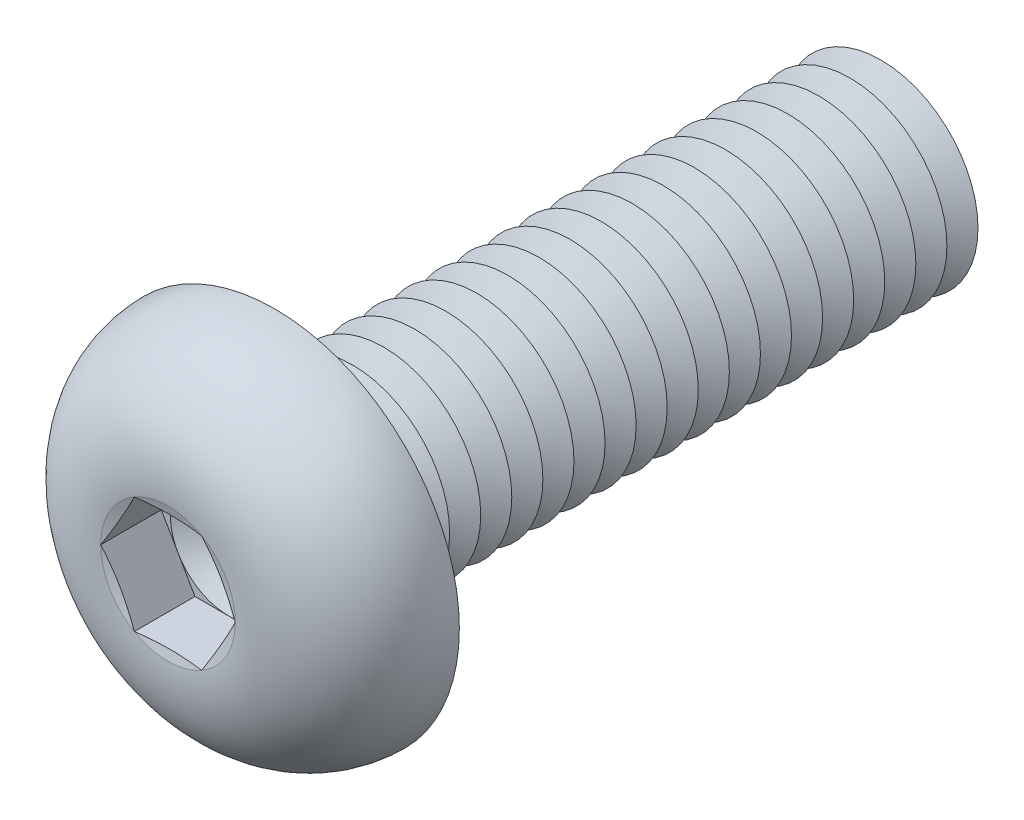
ISO-10303-21;
HEADER;
FILE_DESCRIPTION(('STEP AP214'),'2;1');
FILE_NAME('part.step','',(''),(''),'','','');
FILE_SCHEMA(('AUTOMOTIVE_DESIGN { 1 0 10303 214 1 1 1 1 }'));
ENDSEC;
DATA;
#1=APPLICATION_CONTEXT('core data for automotive mechanical design processes');
#2=APPLICATION_PROTOCOL_DEFINITION('international standard','automotive_design',2000,#1);
#3=PRODUCT_CONTEXT('',#1,'mechanical');
#4=PRODUCT('Part','Part','',(#3));
#5=PRODUCT_RELATED_PRODUCT_CATEGORY('part','',(#4));
#6=PRODUCT_DEFINITION_FORMATION('','',#4);
#7=PRODUCT_DEFINITION_CONTEXT('part definition',#1,'design');
#8=PRODUCT_DEFINITION('design','',#6,#7);
#9=PRODUCT_DEFINITION_SHAPE('','',#8);
#10=(LENGTH_UNIT() NAMED_UNIT(*) SI_UNIT(.MILLI.,.METRE.));
#11=(NAMED_UNIT(*) PLANE_ANGLE_UNIT() SI_UNIT($,.RADIAN.));
#12=(NAMED_UNIT(*) SI_UNIT($,.STERADIAN.) SOLID_ANGLE_UNIT());
#13=UNCERTAINTY_MEASURE_WITH_UNIT(LENGTH_MEASURE(1.E-05),#10,'distance_accuracy_value','');
#14=(GEOMETRIC_REPRESENTATION_CONTEXT(3) GLOBAL_UNCERTAINTY_ASSIGNED_CONTEXT((#13)) GLOBAL_UNIT_ASSIGNED_CONTEXT((#10,
#11,#12)) REPRESENTATION_CONTEXT('',''));
#15=CARTESIAN_POINT('',(0.,0.,0.));
#16=DIRECTION('',(0.,0.,1.));
#17=DIRECTION('',(1.,0.,0.));
#18=AXIS2_PLACEMENT_3D('',#15,#16,#17);
#19=CARTESIAN_POINT('',(0.,0.,1.19));
#20=DIRECTION('',(0.,0.,1.));
#21=DIRECTION('',(1.,0.,0.));
#22=AXIS2_PLACEMENT_3D('',#19,#20,#21);
#23=PLANE('',#22);
#24=CARTESIAN_POINT('',(0.,0.,1.19));
#25=DIRECTION('',(0.,0.,1.));
#26=DIRECTION('',(1.,0.,0.));
#27=AXIS2_PLACEMENT_3D('',#24,#25,#26);
#28=CIRCLE('',#27,1.49999930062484);
#29=CARTESIAN_POINT('',(1.2990375,0.749999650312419,1.19));
#30=VERTEX_POINT('',#29);
#31=CARTESIAN_POINT('',(0.,1.49999930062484,1.19));
#32=VERTEX_POINT('',#31);
#33=EDGE_CURVE('E118',#30,#32,#28,.T.);
#34=ORIENTED_EDGE('',*,*,#33,.F.);
#35=DIRECTION('',(-0.5,0.866025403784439,0.));
#36=VECTOR('',#35,1.);
#37=CARTESIAN_POINT('',(1.73205,0.,1.19));
#38=LINE('',#37,#36);
#39=CARTESIAN_POINT('',(0.866025,1.49999930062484,1.19));
#40=VERTEX_POINT('',#39);
#41=EDGE_CURVE('E125',#30,#40,#38,.T.);
#42=ORIENTED_EDGE('',*,*,#41,.T.);
#43=DIRECTION('',(-1.,0.,0.));
#44=VECTOR('',#43,1.);
#45=CARTESIAN_POINT('',(0.866025,1.49999930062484,1.19));
#46=LINE('',#45,#44);
#47=EDGE_CURVE('E136',#40,#32,#46,.T.);
#48=ORIENTED_EDGE('',*,*,#47,.T.);
#49=EDGE_LOOP('',(#34,#42,#48));
#50=FACE_BOUND('',#49,.T.);
#51=ADVANCED_FACE('F39',(#50),#23,.T.);
#52=CARTESIAN_POINT('',(0.,0.,1.19));
#53=DIRECTION('',(0.,0.,1.));
#54=DIRECTION('',(1.,0.,0.));
#55=AXIS2_PLACEMENT_3D('',#52,#53,#54);
#56=CIRCLE('',#55,1.49999930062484);
#57=CARTESIAN_POINT('',(-1.2990375,0.749999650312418,1.19));
#58=VERTEX_POINT('',#57);
#59=EDGE_CURVE('E11',#32,#58,#56,.T.);
#60=ORIENTED_EDGE('',*,*,#59,.F.);
#61=CARTESIAN_POINT('',(-0.866025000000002,1.49999930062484,1.19));
#62=VERTEX_POINT('',#61);
#63=EDGE_CURVE('E131',#32,#62,#46,.T.);
#64=ORIENTED_EDGE('',*,*,#63,.T.);
#65=DIRECTION('',(-0.5,-0.866025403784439,0.));
#66=VECTOR('',#65,1.);
#67=CARTESIAN_POINT('',(-0.866025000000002,1.49999930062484,1.19));
#68=LINE('',#67,#66);
#69=EDGE_CURVE('E134',#62,#58,#68,.T.);
#70=ORIENTED_EDGE('',*,*,#69,.T.);
#71=EDGE_LOOP('',(#60,#64,#70));
#72=FACE_BOUND('',#71,.T.);
#73=ADVANCED_FACE('F130',(#72),#23,.T.);
#74=CARTESIAN_POINT('',(-1.2990375,-0.749999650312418,1.19));
#75=VERTEX_POINT('',#74);
#76=EDGE_CURVE('E49',#58,#75,#56,.T.);
#77=ORIENTED_EDGE('',*,*,#76,.F.);
#78=CARTESIAN_POINT('',(-1.73205,0.,1.19));
#79=VERTEX_POINT('',#78);
#80=EDGE_CURVE('E143',#58,#79,#68,.T.);
#81=ORIENTED_EDGE('',*,*,#80,.T.);
#82=DIRECTION('',(0.5,-0.866025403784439,0.));
#83=VECTOR('',#82,1.);
#84=CARTESIAN_POINT('',(-1.73205,0.,1.19));
#85=LINE('',#84,#83);
#86=EDGE_CURVE('E151',#79,#75,#85,.T.);
#87=ORIENTED_EDGE('',*,*,#86,.T.);
#88=EDGE_LOOP('',(#77,#81,#87));
#89=FACE_BOUND('',#88,.T.);
#90=ADVANCED_FACE('F427',(#89),#23,.T.);
#91=CARTESIAN_POINT('',(0.,-1.49999930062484,1.19));
#92=VERTEX_POINT('',#91);
#93=EDGE_CURVE('E410',#75,#92,#56,.T.);
#94=ORIENTED_EDGE('',*,*,#93,.F.);
#95=CARTESIAN_POINT('',(-0.866025,-1.49999930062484,1.19));
#96=VERTEX_POINT('',#95);
#97=EDGE_CURVE('E150',#75,#96,#85,.T.);
#98=ORIENTED_EDGE('',*,*,#97,.T.);
#99=DIRECTION('',(1.,0.,0.));
#100=VECTOR('',#99,1.);
#101=CARTESIAN_POINT('',(-0.866025,-1.49999930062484,1.19));
#102=LINE('',#101,#100);
#103=EDGE_CURVE('E156',#96,#92,#102,.T.);
#104=ORIENTED_EDGE('',*,*,#103,.T.);
#105=EDGE_LOOP('',(#94,#98,#104));
#106=FACE_BOUND('',#105,.T.);
#107=ADVANCED_FACE('F420',(#106),#23,.T.);
#108=CARTESIAN_POINT('',(1.2990375,-0.749999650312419,1.19));
#109=VERTEX_POINT('',#108);
#110=EDGE_CURVE('E56',#92,#109,#56,.T.);
#111=ORIENTED_EDGE('',*,*,#110,.F.);
#112=CARTESIAN_POINT('',(0.866025,-1.49999930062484,1.19));
#113=VERTEX_POINT('',#112);
#114=EDGE_CURVE('E155',#92,#113,#102,.T.);
#115=ORIENTED_EDGE('',*,*,#114,.T.);
#116=DIRECTION('',(0.5,0.866025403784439,0.));
#117=VECTOR('',#116,1.);
#118=CARTESIAN_POINT('',(0.866025,-1.49999930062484,1.19));
#119=LINE('',#118,#117);
#120=EDGE_CURVE('E161',#113,#109,#119,.T.);
#121=ORIENTED_EDGE('',*,*,#120,.T.);
#122=EDGE_LOOP('',(#111,#115,#121));
#123=FACE_BOUND('',#122,.T.);
#124=ADVANCED_FACE('F499',(#123),#23,.T.);
#125=CARTESIAN_POINT('',(0.,0.,2.75));
#126=DIRECTION('',(0.,0.,1.));
#127=DIRECTION('',(1.,0.,0.));
#128=AXIS2_PLACEMENT_3D('',#125,#126,#127);
#129=CONICAL_SURFACE('',#128,1.73205,1.30899693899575);
#130=CARTESIAN_POINT('',(1.73216547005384,-0.000200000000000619,2.75003094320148));
#131=CARTESIAN_POINT('',(1.69619207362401,0.0621077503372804,2.74038633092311));
#132=CARTESIAN_POINT('',(1.66015343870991,0.124528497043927,2.73163050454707));
#133=CARTESIAN_POINT('',(1.58794885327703,0.249590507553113,2.71624720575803));
#134=CARTESIAN_POINT('',(1.5517828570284,0.312231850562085,2.70962059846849));
#135=CARTESIAN_POINT('',(1.47954289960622,0.437355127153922,2.69888271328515));
#136=CARTESIAN_POINT('',(1.4434694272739,0.499836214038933,2.69475862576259));
#137=CARTESIAN_POINT('',(1.37127646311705,0.624878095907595,2.68922863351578));
#138=CARTESIAN_POINT('',(1.33515698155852,0.687438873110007,2.68782220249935));
#139=CARTESIAN_POINT('',(1.26291801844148,0.812560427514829,2.68782220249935));
#140=CARTESIAN_POINT('',(1.22679853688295,0.87512120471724,2.68922863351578));
#141=CARTESIAN_POINT('',(1.1546055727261,1.0001630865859,2.69475862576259));
#142=CARTESIAN_POINT('',(1.11853210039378,1.06264417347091,2.69888271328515));
#143=CARTESIAN_POINT('',(1.0462921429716,1.18776745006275,2.70962059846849));
#144=CARTESIAN_POINT('',(1.01012614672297,1.25040879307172,2.71624720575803));
#145=CARTESIAN_POINT('',(0.937921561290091,1.37547080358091,2.73163050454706));
#146=CARTESIAN_POINT('',(0.901882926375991,1.43789155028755,2.74038633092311));
#147=CARTESIAN_POINT('',(0.865909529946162,1.50019930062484,2.75003094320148));
#148=B_SPLINE_CURVE_WITH_KNOTS('',3,(#130,#131,#132,#133,#134,#135,#136,#137,#138,#139,#140,
#141,#142,#143,#144,#145,#146,#147),.UNSPECIFIED.,.F.,.F.,(4,2,2,2,2,2,2,2,4),(0.,
0.217782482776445,0.435653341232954,0.652399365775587,0.869103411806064,1.08580745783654,
1.30255348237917,1.52042434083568,1.73820682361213),.UNSPECIFIED.);
#149=CARTESIAN_POINT('',(1.73205,0.,2.75));
#150=VERTEX_POINT('',#149);
#151=CARTESIAN_POINT('',(0.866025,1.49999930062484,2.75));
#152=VERTEX_POINT('',#151);
#153=EDGE_CURVE('E220',#150,#152,#148,.T.);
#154=ORIENTED_EDGE('',*,*,#153,.F.);
#155=CARTESIAN_POINT('',(0.,0.,2.75));
#156=DIRECTION('',(0.,0.,-1.));
#157=DIRECTION('',(-1.,0.,0.));
#158=AXIS2_PLACEMENT_3D('',#155,#156,#157);
#159=CIRCLE('',#158,1.73205);
#160=EDGE_CURVE('E458',#152,#150,#159,.T.);
#161=ORIENTED_EDGE('',*,*,#160,.F.);
#162=EDGE_LOOP('',(#154,#161));
#163=FACE_BOUND('',#162,.T.);
#164=ADVANCED_FACE('F503',(#163),#129,.F.);
#165=CARTESIAN_POINT('',(0.865909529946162,-1.50019930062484,2.75003094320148));
#166=CARTESIAN_POINT('',(0.901882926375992,-1.43789155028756,2.74038633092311));
#167=CARTESIAN_POINT('',(0.937921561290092,-1.37547080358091,2.73163050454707));
#168=CARTESIAN_POINT('',(1.01012614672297,-1.25040879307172,2.71624720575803));
#169=CARTESIAN_POINT('',(1.0462921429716,-1.18776745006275,2.70962059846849));
#170=CARTESIAN_POINT('',(1.11853210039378,-1.06264417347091,2.69888271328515));
#171=CARTESIAN_POINT('',(1.1546055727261,-1.0001630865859,2.69475862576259));
#172=CARTESIAN_POINT('',(1.22679853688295,-0.875121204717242,2.68922863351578));
#173=CARTESIAN_POINT('',(1.26291801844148,-0.81256042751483,2.68782220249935));
#174=CARTESIAN_POINT('',(1.33515698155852,-0.687438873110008,2.68782220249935));
#175=CARTESIAN_POINT('',(1.37127646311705,-0.624878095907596,2.68922863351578));
#176=CARTESIAN_POINT('',(1.4434694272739,-0.499836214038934,2.69475862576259));
#177=CARTESIAN_POINT('',(1.47954289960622,-0.437355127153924,2.69888271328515));
#178=CARTESIAN_POINT('',(1.5517828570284,-0.312231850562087,2.70962059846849));
#179=CARTESIAN_POINT('',(1.58794885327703,-0.249590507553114,2.71624720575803));
#180=CARTESIAN_POINT('',(1.66015343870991,-0.124528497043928,2.73163050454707));
#181=CARTESIAN_POINT('',(1.69619207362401,-0.0621077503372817,2.74038633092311));
#182=CARTESIAN_POINT('',(1.73216547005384,0.000199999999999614,2.75003094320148));
#183=B_SPLINE_CURVE_WITH_KNOTS('',3,(#165,#166,#167,#168,#169,#170,#171,#172,#173,#174,#175,
#176,#177,#178,#179,#180,#181,#182),.UNSPECIFIED.,.F.,.F.,(4,2,2,2,2,2,2,2,4),(0.,
0.217782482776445,0.435653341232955,0.652399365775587,0.869103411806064,1.08580745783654,
1.30255348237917,1.52042434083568,1.73820682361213),.UNSPECIFIED.);
#184=CARTESIAN_POINT('',(0.866025,-1.49999930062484,2.75));
#185=VERTEX_POINT('',#184);
#186=EDGE_CURVE('E229',#185,#150,#183,.T.);
#187=ORIENTED_EDGE('',*,*,#186,.F.);
#188=EDGE_CURVE('E460',#150,#185,#159,.T.);
#189=ORIENTED_EDGE('',*,*,#188,.F.);
#190=EDGE_LOOP('',(#187,#189));
#191=FACE_BOUND('',#190,.T.);
#192=ADVANCED_FACE('F465',(#191),#129,.F.);
#193=CARTESIAN_POINT('',(-2.61375031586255,-1.49999930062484,3.09338600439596));
#194=CARTESIAN_POINT('',(-2.48719895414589,-1.49999930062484,3.06401688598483));
#195=CARTESIAN_POINT('',(-2.36054180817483,-1.49999930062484,3.03507426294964));
#196=CARTESIAN_POINT('',(-2.10688190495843,-1.49999930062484,2.97862489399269));
#197=CARTESIAN_POINT('',(-1.97987908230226,-1.49999930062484,2.95111844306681));
#198=CARTESIAN_POINT('',(-1.72425281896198,-1.49999930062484,2.89788845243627));
#199=CARTESIAN_POINT('',(-1.59562534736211,-1.49999930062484,2.87218404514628));
#200=CARTESIAN_POINT('',(-1.33776732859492,-1.49999930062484,2.82387586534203));
#201=CARTESIAN_POINT('',(-1.20853672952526,-1.49999930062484,2.80127236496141));
#202=CARTESIAN_POINT('',(-0.952831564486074,-1.49999930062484,2.76126658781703));
#203=CARTESIAN_POINT('',(-0.826376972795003,-1.49999930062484,2.74374018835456));
#204=CARTESIAN_POINT('',(-0.572755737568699,-1.49999930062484,2.71502809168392));
#205=CARTESIAN_POINT('',(-0.445589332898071,-1.49999930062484,2.70384038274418));
#206=CARTESIAN_POINT('',(-0.191333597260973,-1.49999930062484,2.68972083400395));
#207=CARTESIAN_POINT('',(-0.0642464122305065,-1.49999930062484,2.68675270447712));
#208=CARTESIAN_POINT('',(0.189835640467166,-1.49999930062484,2.68959577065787));
#209=CARTESIAN_POINT('',(0.31683049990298,-1.49999930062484,2.69540767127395));
#210=CARTESIAN_POINT('',(0.53418249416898,-1.49999930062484,2.71190493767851));
#211=CARTESIAN_POINT('',(0.624691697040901,-1.49999930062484,2.72073513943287));
#212=CARTESIAN_POINT('',(0.805336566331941,-1.49999930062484,2.74156379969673));
#213=CARTESIAN_POINT('',(0.895472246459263,-1.49999930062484,2.75356214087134));
#214=CARTESIAN_POINT('',(1.0756572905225,-1.49999930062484,2.78006977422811));
#215=CARTESIAN_POINT('',(1.16570548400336,-1.49999930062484,2.7945868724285));
#216=CARTESIAN_POINT('',(1.3454787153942,-1.49999930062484,2.82550612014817));
#217=CARTESIAN_POINT('',(1.43520373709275,-1.49999930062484,2.8419083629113));
#218=CARTESIAN_POINT('',(1.61622412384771,-1.49999930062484,2.87648604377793));
#219=CARTESIAN_POINT('',(1.70751379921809,-1.49999930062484,2.89469103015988));
#220=CARTESIAN_POINT('',(1.88986344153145,-1.49999930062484,2.93221618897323));
#221=CARTESIAN_POINT('',(1.98092340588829,-1.49999930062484,2.95153637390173));
#222=CARTESIAN_POINT('',(2.16236354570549,-1.49999930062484,2.99091506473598));
#223=CARTESIAN_POINT('',(2.25274472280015,-1.49999930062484,3.01096897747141));
#224=CARTESIAN_POINT('',(2.43335289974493,-1.49999930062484,3.05173139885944));
#225=CARTESIAN_POINT('',(2.52357990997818,-1.49999930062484,3.07243986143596));
#226=CARTESIAN_POINT('',(2.61375031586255,-1.49999930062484,3.09338600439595));
#227=B_SPLINE_CURVE_WITH_KNOTS('',3,(#193,#194,#195,#196,#197,#198,#199,#200,#201,#202,#203,
#204,#205,#206,#207,#208,#209,#210,#211,#212,#213,#214,#215,#216,#217,#218,#219,#220,#221,#222,
#223,#224,#225,#226),.UNSPECIFIED.,.F.,.F.,(4,2,2,2,2,2,2,2,2,2,2,2,2,2,2,2,4),(0.,
0.389753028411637,0.779585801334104,1.17307326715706,1.5665952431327,1.94947555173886,
2.33223427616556,2.71330039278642,3.09439710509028,3.36715350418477,3.63989980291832,
3.91350699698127,4.18712773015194,4.4663802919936,4.74563598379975,5.02337106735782,
5.3010866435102),.UNSPECIFIED.);
#228=CARTESIAN_POINT('',(-0.866025,-1.49999930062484,2.75));
#229=VERTEX_POINT('',#228);
#230=EDGE_CURVE('E439',#229,#185,#227,.T.);
#231=ORIENTED_EDGE('',*,*,#230,.F.);
#232=EDGE_CURVE('E447',#185,#229,#159,.T.);
#233=ORIENTED_EDGE('',*,*,#232,.F.);
#234=EDGE_LOOP('',(#231,#233));
#235=FACE_BOUND('',#234,.T.);
#236=ADVANCED_FACE('F471',(#235),#129,.F.);
#237=CARTESIAN_POINT('',(-1.73216547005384,0.000200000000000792,2.75003094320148));
#238=CARTESIAN_POINT('',(-1.69619207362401,-0.0621077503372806,2.74038633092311));
#239=CARTESIAN_POINT('',(-1.66015343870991,-0.124528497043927,2.73163050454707));
#240=CARTESIAN_POINT('',(-1.58794885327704,-0.249590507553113,2.71624720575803));
#241=CARTESIAN_POINT('',(-1.55178285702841,-0.312231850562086,2.70962059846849));
#242=CARTESIAN_POINT('',(-1.47954289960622,-0.437355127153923,2.69888271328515));
#243=CARTESIAN_POINT('',(-1.4434694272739,-0.499836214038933,2.69475862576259));
#244=CARTESIAN_POINT('',(-1.37127646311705,-0.624878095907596,2.68922863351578));
#245=CARTESIAN_POINT('',(-1.33515698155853,-0.687438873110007,2.68782220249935));
#246=CARTESIAN_POINT('',(-1.26291801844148,-0.81256042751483,2.68782220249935));
#247=CARTESIAN_POINT('',(-1.22679853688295,-0.875121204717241,2.68922863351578));
#248=CARTESIAN_POINT('',(-1.1546055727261,-1.0001630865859,2.69475862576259));
#249=CARTESIAN_POINT('',(-1.11853210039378,-1.06264417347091,2.69888271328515));
#250=CARTESIAN_POINT('',(-1.0462921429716,-1.18776745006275,2.70962059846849));
#251=CARTESIAN_POINT('',(-1.01012614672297,-1.25040879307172,2.71624720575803));
#252=CARTESIAN_POINT('',(-0.937921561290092,-1.37547080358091,2.73163050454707));
#253=CARTESIAN_POINT('',(-0.901882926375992,-1.43789155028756,2.74038633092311));
#254=CARTESIAN_POINT('',(-0.865909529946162,-1.50019930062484,2.75003094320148));
#255=B_SPLINE_CURVE_WITH_KNOTS('',3,(#237,#238,#239,#240,#241,#242,#243,#244,#245,#246,#247,
#248,#249,#250,#251,#252,#253,#254),.UNSPECIFIED.,.F.,.F.,(4,2,2,2,2,2,2,2,4),(0.,
0.217782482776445,0.435653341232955,0.652399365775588,0.869103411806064,1.08580745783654,
1.30255348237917,1.52042434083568,1.73820682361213),.UNSPECIFIED.);
#256=CARTESIAN_POINT('',(-1.73205,0.,2.75));
#257=VERTEX_POINT('',#256);
#258=EDGE_CURVE('E432',#257,#229,#255,.T.);
#259=ORIENTED_EDGE('',*,*,#258,.F.);
#260=EDGE_CURVE('E394',#229,#257,#159,.T.);
#261=ORIENTED_EDGE('',*,*,#260,.F.);
#262=EDGE_LOOP('',(#259,#261));
#263=FACE_BOUND('',#262,.T.);
#264=ADVANCED_FACE('F436',(#263),#129,.F.);
#265=CARTESIAN_POINT('',(-0.865909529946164,1.50019930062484,2.75003094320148));
#266=CARTESIAN_POINT('',(-0.901882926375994,1.43789155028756,2.74038633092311));
#267=CARTESIAN_POINT('',(-0.937921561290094,1.37547080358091,2.73163050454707));
#268=CARTESIAN_POINT('',(-1.01012614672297,1.25040879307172,2.71624720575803));
#269=CARTESIAN_POINT('',(-1.0462921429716,1.18776745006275,2.70962059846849));
#270=CARTESIAN_POINT('',(-1.11853210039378,1.06264417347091,2.69888271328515));
#271=CARTESIAN_POINT('',(-1.1546055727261,1.0001630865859,2.69475862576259));
#272=CARTESIAN_POINT('',(-1.22679853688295,0.875121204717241,2.68922863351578));
#273=CARTESIAN_POINT('',(-1.26291801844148,0.81256042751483,2.68782220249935));
#274=CARTESIAN_POINT('',(-1.33515698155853,0.687438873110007,2.68782220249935));
#275=CARTESIAN_POINT('',(-1.37127646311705,0.624878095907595,2.68922863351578));
#276=CARTESIAN_POINT('',(-1.4434694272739,0.499836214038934,2.69475862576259));
#277=CARTESIAN_POINT('',(-1.47954289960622,0.437355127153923,2.69888271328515));
#278=CARTESIAN_POINT('',(-1.55178285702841,0.312231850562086,2.70962059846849));
#279=CARTESIAN_POINT('',(-1.58794885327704,0.249590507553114,2.71624720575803));
#280=CARTESIAN_POINT('',(-1.66015343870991,0.124528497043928,2.73163050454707));
#281=CARTESIAN_POINT('',(-1.69619207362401,0.0621077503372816,2.74038633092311));
#282=CARTESIAN_POINT('',(-1.73216547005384,-0.000199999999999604,2.75003094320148));
#283=B_SPLINE_CURVE_WITH_KNOTS('',3,(#265,#266,#267,#268,#269,#270,#271,#272,#273,#274,#275,
#276,#277,#278,#279,#280,#281,#282),.UNSPECIFIED.,.F.,.F.,(4,2,2,2,2,2,2,2,4),(0.,
0.217782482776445,0.435653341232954,0.652399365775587,0.869103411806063,1.08580745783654,
1.30255348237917,1.52042434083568,1.73820682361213),.UNSPECIFIED.);
#284=CARTESIAN_POINT('',(-0.866025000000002,1.49999930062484,2.75));
#285=VERTEX_POINT('',#284);
#286=EDGE_CURVE('E194',#285,#257,#283,.T.);
#287=ORIENTED_EDGE('',*,*,#286,.F.);
#288=EDGE_CURVE('E395',#257,#285,#159,.T.);
#289=ORIENTED_EDGE('',*,*,#288,.F.);
#290=EDGE_LOOP('',(#287,#289));
#291=FACE_BOUND('',#290,.T.);
#292=ADVANCED_FACE('F450',(#291),#129,.F.);
#293=CARTESIAN_POINT('',(0.,0.,-13.2));
#294=DIRECTION('',(0.,0.,1.));
#295=DIRECTION('',(1.,0.,0.));
#296=AXIS2_PLACEMENT_3D('',#293,#294,#295);
#297=CONICAL_SURFACE('',#296,2.50000000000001,1.0471975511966);
#298=CARTESIAN_POINT('',(0.,0.,-13.6));
#299=DIRECTION('',(0.,0.,1.));
#300=DIRECTION('',(1.,0.,0.));
#301=AXIS2_PLACEMENT_3D('',#298,#299,#300);
#302=CIRCLE('',#301,1.80717967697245);
#303=CARTESIAN_POINT('',(1.80717967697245,0.,-13.6));
#304=VERTEX_POINT('',#303);
#305=EDGE_CURVE('E366',#304,#304,#302,.T.);
#306=ORIENTED_EDGE('',*,*,#305,.T.);
#307=EDGE_LOOP('',(#306));
#308=FACE_BOUND('',#307,.T.);
#309=CARTESIAN_POINT('',(0.,0.,-13.2));
#310=DIRECTION('',(0.,0.,1.));
#311=DIRECTION('',(1.,0.,0.));
#312=AXIS2_PLACEMENT_3D('',#309,#310,#311);
#313=CIRCLE('',#312,2.5);
#314=CARTESIAN_POINT('',(2.5,0.,-13.2));
#315=VERTEX_POINT('',#314);
#316=EDGE_CURVE('E362',#315,#315,#313,.T.);
#317=ORIENTED_EDGE('',*,*,#316,.F.);
#318=EDGE_LOOP('',(#317));
#319=FACE_BOUND('',#318,.T.);
#320=ADVANCED_FACE('F638',(#308,#319),#297,.T.);
#321=CARTESIAN_POINT('',(0.,0.,-13.6));
#322=DIRECTION('',(0.,0.,-1.));
#323=DIRECTION('',(-1.,0.,0.));
#324=AXIS2_PLACEMENT_3D('',#321,#322,#323);
#325=CONICAL_SURFACE('',#324,1.80717967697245,1.0471975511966);
#326=CARTESIAN_POINT('',(0.,0.,-14.));
#327=DIRECTION('',(0.,0.,1.));
#328=DIRECTION('',(1.,0.,0.));
#329=AXIS2_PLACEMENT_3D('',#326,#327,#328);
#330=CIRCLE('',#329,2.5);
#331=CARTESIAN_POINT('',(2.5,0.,-14.));
#332=VERTEX_POINT('',#331);
#333=EDGE_CURVE('E370',#332,#332,#330,.T.);
#334=ORIENTED_EDGE('',*,*,#333,.T.);
#335=EDGE_LOOP('',(#334));
#336=FACE_BOUND('',#335,.T.);
#337=ORIENTED_EDGE('',*,*,#305,.F.);
#338=EDGE_LOOP('',(#337));
#339=FACE_BOUND('',#338,.T.);
#340=ADVANCED_FACE('F1000',(#336,#339),#325,.T.);
#341=CARTESIAN_POINT('',(0.,2.50000000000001,-16.));
#342=DIRECTION('',(0.,0.,-1.));
#343=DIRECTION('',(-1.,0.,0.));
#344=AXIS2_PLACEMENT_3D('',#341,#342,#343);
#345=PLANE('',#344);
#346=CARTESIAN_POINT('',(0.,0.,-16.));
#347=DIRECTION('',(0.,0.,1.));
#348=DIRECTION('',(1.,0.,0.));
#349=AXIS2_PLACEMENT_3D('',#346,#347,#348);
#350=CIRCLE('',#349,1.80717967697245);
#351=CARTESIAN_POINT('',(1.80717967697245,0.,-16.));
#352=VERTEX_POINT('',#351);
#353=EDGE_CURVE('E390',#352,#352,#350,.T.);
#354=ORIENTED_EDGE('',*,*,#353,.F.);
#355=EDGE_LOOP('',(#354));
#356=FACE_BOUND('',#355,.T.);
#357=ADVANCED_FACE('F1005',(#356),#345,.T.);
#358=CARTESIAN_POINT('',(0.,0.,-15.6));
#359=DIRECTION('',(0.,0.,1.));
#360=DIRECTION('',(1.,0.,0.));
#361=AXIS2_PLACEMENT_3D('',#358,#359,#360);
#362=CONICAL_SURFACE('',#361,2.50000000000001,1.0471975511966);
#363=ORIENTED_EDGE('',*,*,#353,.T.);
#364=EDGE_LOOP('',(#363));
#365=FACE_BOUND('',#364,.T.);
#366=CARTESIAN_POINT('',(0.,0.,-15.6));
#367=DIRECTION('',(0.,0.,1.));
#368=DIRECTION('',(1.,0.,0.));
#369=AXIS2_PLACEMENT_3D('',#366,#367,#368);
#370=CIRCLE('',#369,2.5);
#371=CARTESIAN_POINT('',(2.5,0.,-15.6));
#372=VERTEX_POINT('',#371);
#373=EDGE_CURVE('E386',#372,#372,#370,.T.);
#374=ORIENTED_EDGE('',*,*,#373,.F.);
#375=EDGE_LOOP('',(#374));
#376=FACE_BOUND('',#375,.T.);
#377=ADVANCED_FACE('F994',(#365,#376),#362,.T.);
#378=CARTESIAN_POINT('',(0.,0.,-15.2));
#379=DIRECTION('',(0.,0.,-1.));
#380=DIRECTION('',(-1.,0.,0.));
#381=AXIS2_PLACEMENT_3D('',#378,#379,#380);
#382=CONICAL_SURFACE('',#381,1.80717967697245,1.0471975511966);
#383=ORIENTED_EDGE('',*,*,#373,.T.);
#384=EDGE_LOOP('',(#383));
#385=FACE_BOUND('',#384,.T.);
#386=CARTESIAN_POINT('',(0.,0.,-15.2));
#387=DIRECTION('',(0.,0.,1.));
#388=DIRECTION('',(1.,0.,0.));
#389=AXIS2_PLACEMENT_3D('',#386,#387,#388);
#390=CIRCLE('',#389,1.80717967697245);
#391=CARTESIAN_POINT('',(1.80717967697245,0.,-15.2));
#392=VERTEX_POINT('',#391);
#393=EDGE_CURVE('E382',#392,#392,#390,.T.);
#394=ORIENTED_EDGE('',*,*,#393,.F.);
#395=EDGE_LOOP('',(#394));
#396=FACE_BOUND('',#395,.T.);
#397=ADVANCED_FACE('F984',(#385,#396),#382,.T.);
#398=CARTESIAN_POINT('',(0.,0.,-14.8));
#399=DIRECTION('',(0.,0.,1.));
#400=DIRECTION('',(1.,0.,0.));
#401=AXIS2_PLACEMENT_3D('',#398,#399,#400);
#402=CONICAL_SURFACE('',#401,2.50000000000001,1.0471975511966);
#403=ORIENTED_EDGE('',*,*,#393,.T.);
#404=EDGE_LOOP('',(#403));
#405=FACE_BOUND('',#404,.T.);
#406=CARTESIAN_POINT('',(0.,0.,-14.8));
#407=DIRECTION('',(0.,0.,1.));
#408=DIRECTION('',(1.,0.,0.));
#409=AXIS2_PLACEMENT_3D('',#406,#407,#408);
#410=CIRCLE('',#409,2.5);
#411=CARTESIAN_POINT('',(2.5,0.,-14.8));
#412=VERTEX_POINT('',#411);
#413=EDGE_CURVE('E378',#412,#412,#410,.T.);
#414=ORIENTED_EDGE('',*,*,#413,.F.);
#415=EDGE_LOOP('',(#414));
#416=FACE_BOUND('',#415,.T.);
#417=ADVANCED_FACE('F974',(#405,#416),#402,.T.);
#418=CARTESIAN_POINT('',(0.,0.,-14.4));
#419=DIRECTION('',(0.,0.,-1.));
#420=DIRECTION('',(-1.,0.,0.));
#421=AXIS2_PLACEMENT_3D('',#418,#419,#420);
#422=CONICAL_SURFACE('',#421,1.80717967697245,1.0471975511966);
#423=ORIENTED_EDGE('',*,*,#413,.T.);
#424=EDGE_LOOP('',(#423));
#425=FACE_BOUND('',#424,.T.);
#426=CARTESIAN_POINT('',(0.,0.,-14.4));
#427=DIRECTION('',(0.,0.,1.));
#428=DIRECTION('',(1.,0.,0.));
#429=AXIS2_PLACEMENT_3D('',#426,#427,#428);
#430=CIRCLE('',#429,1.80717967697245);
#431=CARTESIAN_POINT('',(1.80717967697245,0.,-14.4));
#432=VERTEX_POINT('',#431);
#433=EDGE_CURVE('E374',#432,#432,#430,.T.);
#434=ORIENTED_EDGE('',*,*,#433,.F.);
#435=EDGE_LOOP('',(#434));
#436=FACE_BOUND('',#435,.T.);
#437=ADVANCED_FACE('F964',(#425,#436),#422,.T.);
#438=CARTESIAN_POINT('',(0.,0.,-14.));
#439=DIRECTION('',(0.,0.,1.));
#440=DIRECTION('',(1.,0.,0.));
#441=AXIS2_PLACEMENT_3D('',#438,#439,#440);
#442=CONICAL_SURFACE('',#441,2.50000000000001,1.0471975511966);
#443=ORIENTED_EDGE('',*,*,#433,.T.);
#444=EDGE_LOOP('',(#443));
#445=FACE_BOUND('',#444,.T.);
#446=ORIENTED_EDGE('',*,*,#333,.F.);
#447=EDGE_LOOP('',(#446));
#448=FACE_BOUND('',#447,.T.);
#449=ADVANCED_FACE('F954',(#445,#448),#442,.T.);
#450=CARTESIAN_POINT('',(0.,0.,-12.4));
#451=DIRECTION('',(0.,0.,1.));
#452=DIRECTION('',(1.,0.,0.));
#453=AXIS2_PLACEMENT_3D('',#450,#451,#452);
#454=CONICAL_SURFACE('',#453,2.50000000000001,1.0471975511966);
#455=CARTESIAN_POINT('',(0.,0.,-12.8));
#456=DIRECTION('',(0.,0.,1.));
#457=DIRECTION('',(1.,0.,0.));
#458=AXIS2_PLACEMENT_3D('',#455,#456,#457);
#459=CIRCLE('',#458,1.80717967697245);
#460=CARTESIAN_POINT('',(1.80717967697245,0.,-12.8));
#461=VERTEX_POINT('',#460);
#462=EDGE_CURVE('E358',#461,#461,#459,.T.);
#463=ORIENTED_EDGE('',*,*,#462,.T.);
#464=EDGE_LOOP('',(#463));
#465=FACE_BOUND('',#464,.T.);
#466=CARTESIAN_POINT('',(0.,0.,-12.4));
#467=DIRECTION('',(0.,0.,1.));
#468=DIRECTION('',(1.,0.,0.));
#469=AXIS2_PLACEMENT_3D('',#466,#467,#468);
#470=CIRCLE('',#469,2.5);
#471=CARTESIAN_POINT('',(2.5,0.,-12.4));
#472=VERTEX_POINT('',#471);
#473=EDGE_CURVE('E354',#472,#472,#470,.T.);
#474=ORIENTED_EDGE('',*,*,#473,.F.);
#475=EDGE_LOOP('',(#474));
#476=FACE_BOUND('',#475,.T.);
#477=ADVANCED_FACE('F944',(#465,#476),#454,.T.);
#478=CARTESIAN_POINT('',(0.,0.,-12.8));
#479=DIRECTION('',(0.,0.,-1.));
#480=DIRECTION('',(-1.,0.,0.));
#481=AXIS2_PLACEMENT_3D('',#478,#479,#480);
#482=CONICAL_SURFACE('',#481,1.80717967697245,1.0471975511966);
#483=ORIENTED_EDGE('',*,*,#316,.T.);
#484=EDGE_LOOP('',(#483));
#485=FACE_BOUND('',#484,.T.);
#486=ORIENTED_EDGE('',*,*,#462,.F.);
#487=EDGE_LOOP('',(#486));
#488=FACE_BOUND('',#487,.T.);
#489=ADVANCED_FACE('F934',(#485,#488),#482,.T.);
#490=CARTESIAN_POINT('',(0.,0.,-11.6));
#491=DIRECTION('',(0.,0.,1.));
#492=DIRECTION('',(1.,0.,0.));
#493=AXIS2_PLACEMENT_3D('',#490,#491,#492);
#494=CONICAL_SURFACE('',#493,2.50000000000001,1.0471975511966);
#495=CARTESIAN_POINT('',(0.,0.,-12.));
#496=DIRECTION('',(0.,0.,1.));
#497=DIRECTION('',(1.,0.,0.));
#498=AXIS2_PLACEMENT_3D('',#495,#496,#497);
#499=CIRCLE('',#498,1.80717967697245);
#500=CARTESIAN_POINT('',(1.80717967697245,0.,-12.));
#501=VERTEX_POINT('',#500);
#502=EDGE_CURVE('E350',#501,#501,#499,.T.);
#503=ORIENTED_EDGE('',*,*,#502,.T.);
#504=EDGE_LOOP('',(#503));
#505=FACE_BOUND('',#504,.T.);
#506=CARTESIAN_POINT('',(0.,0.,-11.6));
#507=DIRECTION('',(0.,0.,1.));
#508=DIRECTION('',(1.,0.,0.));
#509=AXIS2_PLACEMENT_3D('',#506,#507,#508);
#510=CIRCLE('',#509,2.5);
#511=CARTESIAN_POINT('',(2.5,0.,-11.6));
#512=VERTEX_POINT('',#511);
#513=EDGE_CURVE('E346',#512,#512,#510,.T.);
#514=ORIENTED_EDGE('',*,*,#513,.F.);
#515=EDGE_LOOP('',(#514));
#516=FACE_BOUND('',#515,.T.);
#517=ADVANCED_FACE('F924',(#505,#516),#494,.T.);
#518=CARTESIAN_POINT('',(0.,0.,-12.));
#519=DIRECTION('',(0.,0.,-1.));
#520=DIRECTION('',(-1.,0.,0.));
#521=AXIS2_PLACEMENT_3D('',#518,#519,#520);
#522=CONICAL_SURFACE('',#521,1.80717967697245,1.0471975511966);
#523=ORIENTED_EDGE('',*,*,#473,.T.);
#524=EDGE_LOOP('',(#523));
#525=FACE_BOUND('',#524,.T.);
#526=ORIENTED_EDGE('',*,*,#502,.F.);
#527=EDGE_LOOP('',(#526));
#528=FACE_BOUND('',#527,.T.);
#529=ADVANCED_FACE('F914',(#525,#528),#522,.T.);
#530=CARTESIAN_POINT('',(0.,0.,-10.8));
#531=DIRECTION('',(0.,0.,1.));
#532=DIRECTION('',(1.,0.,0.));
#533=AXIS2_PLACEMENT_3D('',#530,#531,#532);
#534=CONICAL_SURFACE('',#533,2.50000000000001,1.0471975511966);
#535=CARTESIAN_POINT('',(0.,0.,-11.2));
#536=DIRECTION('',(0.,0.,1.));
#537=DIRECTION('',(1.,0.,0.));
#538=AXIS2_PLACEMENT_3D('',#535,#536,#537);
#539=CIRCLE('',#538,1.80717967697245);
#540=CARTESIAN_POINT('',(1.80717967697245,0.,-11.2));
#541=VERTEX_POINT('',#540);
#542=EDGE_CURVE('E342',#541,#541,#539,.T.);
#543=ORIENTED_EDGE('',*,*,#542,.T.);
#544=EDGE_LOOP('',(#543));
#545=FACE_BOUND('',#544,.T.);
#546=CARTESIAN_POINT('',(0.,0.,-10.8));
#547=DIRECTION('',(0.,0.,1.));
#548=DIRECTION('',(1.,0.,0.));
#549=AXIS2_PLACEMENT_3D('',#546,#547,#548);
#550=CIRCLE('',#549,2.5);
#551=CARTESIAN_POINT('',(2.5,0.,-10.8));
#552=VERTEX_POINT('',#551);
#553=EDGE_CURVE('E338',#552,#552,#550,.T.);
#554=ORIENTED_EDGE('',*,*,#553,.F.);
#555=EDGE_LOOP('',(#554));
#556=FACE_BOUND('',#555,.T.);
#557=ADVANCED_FACE('F904',(#545,#556),#534,.T.);
#558=CARTESIAN_POINT('',(0.,0.,-11.2));
#559=DIRECTION('',(0.,0.,-1.));
#560=DIRECTION('',(-1.,0.,0.));
#561=AXIS2_PLACEMENT_3D('',#558,#559,#560);
#562=CONICAL_SURFACE('',#561,1.80717967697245,1.0471975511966);
#563=ORIENTED_EDGE('',*,*,#513,.T.);
#564=EDGE_LOOP('',(#563));
#565=FACE_BOUND('',#564,.T.);
#566=ORIENTED_EDGE('',*,*,#542,.F.);
#567=EDGE_LOOP('',(#566));
#568=FACE_BOUND('',#567,.T.);
#569=ADVANCED_FACE('F894',(#565,#568),#562,.T.);
#570=CARTESIAN_POINT('',(0.,0.,-9.99999999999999));
#571=DIRECTION('',(0.,0.,1.));
#572=DIRECTION('',(1.,0.,0.));
#573=AXIS2_PLACEMENT_3D('',#570,#571,#572);
#574=CONICAL_SURFACE('',#573,2.50000000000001,1.0471975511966);
#575=CARTESIAN_POINT('',(0.,0.,-10.4));
#576=DIRECTION('',(0.,0.,1.));
#577=DIRECTION('',(1.,0.,0.));
#578=AXIS2_PLACEMENT_3D('',#575,#576,#577);
#579=CIRCLE('',#578,1.80717967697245);
#580=CARTESIAN_POINT('',(1.80717967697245,0.,-10.4));
#581=VERTEX_POINT('',#580);
#582=EDGE_CURVE('E334',#581,#581,#579,.T.);
#583=ORIENTED_EDGE('',*,*,#582,.T.);
#584=EDGE_LOOP('',(#583));
#585=FACE_BOUND('',#584,.T.);
#586=CARTESIAN_POINT('',(0.,0.,-10.));
#587=DIRECTION('',(0.,0.,1.));
#588=DIRECTION('',(1.,0.,0.));
#589=AXIS2_PLACEMENT_3D('',#586,#587,#588);
#590=CIRCLE('',#589,2.5);
#591=CARTESIAN_POINT('',(2.5,0.,-10.));
#592=VERTEX_POINT('',#591);
#593=EDGE_CURVE('E330',#592,#592,#590,.T.);
#594=ORIENTED_EDGE('',*,*,#593,.F.);
#595=EDGE_LOOP('',(#594));
#596=FACE_BOUND('',#595,.T.);
#597=ADVANCED_FACE('F884',(#585,#596),#574,.T.);
#598=CARTESIAN_POINT('',(0.,0.,-10.4));
#599=DIRECTION('',(0.,0.,-1.));
#600=DIRECTION('',(-1.,0.,0.));
#601=AXIS2_PLACEMENT_3D('',#598,#599,#600);
#602=CONICAL_SURFACE('',#601,1.80717967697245,1.0471975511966);
#603=ORIENTED_EDGE('',*,*,#553,.T.);
#604=EDGE_LOOP('',(#603));
#605=FACE_BOUND('',#604,.T.);
#606=ORIENTED_EDGE('',*,*,#582,.F.);
#607=EDGE_LOOP('',(#606));
#608=FACE_BOUND('',#607,.T.);
#609=ADVANCED_FACE('F874',(#605,#608),#602,.T.);
#610=CARTESIAN_POINT('',(0.,0.,-9.2));
#611=DIRECTION('',(0.,0.,1.));
#612=DIRECTION('',(1.,0.,0.));
#613=AXIS2_PLACEMENT_3D('',#610,#611,#612);
#614=CONICAL_SURFACE('',#613,2.50000000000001,1.0471975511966);
#615=CARTESIAN_POINT('',(0.,0.,-9.6));
#616=DIRECTION('',(0.,0.,1.));
#617=DIRECTION('',(1.,0.,0.));
#618=AXIS2_PLACEMENT_3D('',#615,#616,#617);
#619=CIRCLE('',#618,1.80717967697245);
#620=CARTESIAN_POINT('',(1.80717967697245,0.,-9.6));
#621=VERTEX_POINT('',#620);
#622=EDGE_CURVE('E326',#621,#621,#619,.T.);
#623=ORIENTED_EDGE('',*,*,#622,.T.);
#624=EDGE_LOOP('',(#623));
#625=FACE_BOUND('',#624,.T.);
#626=CARTESIAN_POINT('',(0.,0.,-9.2));
#627=DIRECTION('',(0.,0.,1.));
#628=DIRECTION('',(1.,0.,0.));
#629=AXIS2_PLACEMENT_3D('',#626,#627,#628);
#630=CIRCLE('',#629,2.5);
#631=CARTESIAN_POINT('',(2.5,0.,-9.2));
#632=VERTEX_POINT('',#631);
#633=EDGE_CURVE('E322',#632,#632,#630,.T.);
#634=ORIENTED_EDGE('',*,*,#633,.F.);
#635=EDGE_LOOP('',(#634));
#636=FACE_BOUND('',#635,.T.);
#637=ADVANCED_FACE('F864',(#625,#636),#614,.T.);
#638=CARTESIAN_POINT('',(0.,0.,-9.6));
#639=DIRECTION('',(0.,0.,-1.));
#640=DIRECTION('',(-1.,0.,0.));
#641=AXIS2_PLACEMENT_3D('',#638,#639,#640);
#642=CONICAL_SURFACE('',#641,1.80717967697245,1.0471975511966);
#643=ORIENTED_EDGE('',*,*,#593,.T.);
#644=EDGE_LOOP('',(#643));
#645=FACE_BOUND('',#644,.T.);
#646=ORIENTED_EDGE('',*,*,#622,.F.);
#647=EDGE_LOOP('',(#646));
#648=FACE_BOUND('',#647,.T.);
#649=ADVANCED_FACE('F854',(#645,#648),#642,.T.);
#650=CARTESIAN_POINT('',(0.,0.,-8.4));
#651=DIRECTION('',(0.,0.,1.));
#652=DIRECTION('',(1.,0.,0.));
#653=AXIS2_PLACEMENT_3D('',#650,#651,#652);
#654=CONICAL_SURFACE('',#653,2.50000000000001,1.0471975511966);
#655=CARTESIAN_POINT('',(0.,0.,-8.8));
#656=DIRECTION('',(0.,0.,1.));
#657=DIRECTION('',(1.,0.,0.));
#658=AXIS2_PLACEMENT_3D('',#655,#656,#657);
#659=CIRCLE('',#658,1.80717967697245);
#660=CARTESIAN_POINT('',(1.80717967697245,0.,-8.8));
#661=VERTEX_POINT('',#660);
#662=EDGE_CURVE('E318',#661,#661,#659,.T.);
#663=ORIENTED_EDGE('',*,*,#662,.T.);
#664=EDGE_LOOP('',(#663));
#665=FACE_BOUND('',#664,.T.);
#666=CARTESIAN_POINT('',(0.,0.,-8.4));
#667=DIRECTION('',(0.,0.,1.));
#668=DIRECTION('',(1.,0.,0.));
#669=AXIS2_PLACEMENT_3D('',#666,#667,#668);
#670=CIRCLE('',#669,2.5);
#671=CARTESIAN_POINT('',(2.5,0.,-8.4));
#672=VERTEX_POINT('',#671);
#673=EDGE_CURVE('E314',#672,#672,#670,.T.);
#674=ORIENTED_EDGE('',*,*,#673,.F.);
#675=EDGE_LOOP('',(#674));
#676=FACE_BOUND('',#675,.T.);
#677=ADVANCED_FACE('F844',(#665,#676),#654,.T.);
#678=CARTESIAN_POINT('',(0.,0.,-8.8));
#679=DIRECTION('',(0.,0.,-1.));
#680=DIRECTION('',(-1.,0.,0.));
#681=AXIS2_PLACEMENT_3D('',#678,#679,#680);
#682=CONICAL_SURFACE('',#681,1.80717967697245,1.0471975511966);
#683=ORIENTED_EDGE('',*,*,#633,.T.);
#684=EDGE_LOOP('',(#683));
#685=FACE_BOUND('',#684,.T.);
#686=ORIENTED_EDGE('',*,*,#662,.F.);
#687=EDGE_LOOP('',(#686));
#688=FACE_BOUND('',#687,.T.);
#689=ADVANCED_FACE('F834',(#685,#688),#682,.T.);
#690=CARTESIAN_POINT('',(0.,0.,-7.6));
#691=DIRECTION('',(0.,0.,1.));
#692=DIRECTION('',(1.,0.,0.));
#693=AXIS2_PLACEMENT_3D('',#690,#691,#692);
#694=CONICAL_SURFACE('',#693,2.50000000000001,1.0471975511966);
#695=CARTESIAN_POINT('',(0.,0.,-8.));
#696=DIRECTION('',(0.,0.,1.));
#697=DIRECTION('',(1.,0.,0.));
#698=AXIS2_PLACEMENT_3D('',#695,#696,#697);
#699=CIRCLE('',#698,1.80717967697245);
#700=CARTESIAN_POINT('',(1.80717967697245,0.,-8.));
#701=VERTEX_POINT('',#700);
#702=EDGE_CURVE('E310',#701,#701,#699,.T.);
#703=ORIENTED_EDGE('',*,*,#702,.T.);
#704=EDGE_LOOP('',(#703));
#705=FACE_BOUND('',#704,.T.);
#706=CARTESIAN_POINT('',(0.,0.,-7.6));
#707=DIRECTION('',(0.,0.,1.));
#708=DIRECTION('',(1.,0.,0.));
#709=AXIS2_PLACEMENT_3D('',#706,#707,#708);
#710=CIRCLE('',#709,2.5);
#711=CARTESIAN_POINT('',(2.5,0.,-7.6));
#712=VERTEX_POINT('',#711);
#713=EDGE_CURVE('E306',#712,#712,#710,.T.);
#714=ORIENTED_EDGE('',*,*,#713,.F.);
#715=EDGE_LOOP('',(#714));
#716=FACE_BOUND('',#715,.T.);
#717=ADVANCED_FACE('F824',(#705,#716),#694,.T.);
#718=CARTESIAN_POINT('',(0.,0.,-8.));
#719=DIRECTION('',(0.,0.,-1.));
#720=DIRECTION('',(-1.,0.,0.));
#721=AXIS2_PLACEMENT_3D('',#718,#719,#720);
#722=CONICAL_SURFACE('',#721,1.80717967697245,1.0471975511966);
#723=ORIENTED_EDGE('',*,*,#673,.T.);
#724=EDGE_LOOP('',(#723));
#725=FACE_BOUND('',#724,.T.);
#726=ORIENTED_EDGE('',*,*,#702,.F.);
#727=EDGE_LOOP('',(#726));
#728=FACE_BOUND('',#727,.T.);
#729=ADVANCED_FACE('F814',(#725,#728),#722,.T.);
#730=CARTESIAN_POINT('',(0.,0.,-6.8));
#731=DIRECTION('',(0.,0.,1.));
#732=DIRECTION('',(1.,0.,0.));
#733=AXIS2_PLACEMENT_3D('',#730,#731,#732);
#734=CONICAL_SURFACE('',#733,2.50000000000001,1.0471975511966);
#735=CARTESIAN_POINT('',(0.,0.,-7.2));
#736=DIRECTION('',(0.,0.,1.));
#737=DIRECTION('',(1.,0.,0.));
#738=AXIS2_PLACEMENT_3D('',#735,#736,#737);
#739=CIRCLE('',#738,1.80717967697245);
#740=CARTESIAN_POINT('',(1.80717967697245,0.,-7.2));
#741=VERTEX_POINT('',#740);
#742=EDGE_CURVE('E302',#741,#741,#739,.T.);
#743=ORIENTED_EDGE('',*,*,#742,.T.);
#744=EDGE_LOOP('',(#743));
#745=FACE_BOUND('',#744,.T.);
#746=CARTESIAN_POINT('',(0.,0.,-6.8));
#747=DIRECTION('',(0.,0.,1.));
#748=DIRECTION('',(1.,0.,0.));
#749=AXIS2_PLACEMENT_3D('',#746,#747,#748);
#750=CIRCLE('',#749,2.5);
#751=CARTESIAN_POINT('',(2.5,0.,-6.8));
#752=VERTEX_POINT('',#751);
#753=EDGE_CURVE('E298',#752,#752,#750,.T.);
#754=ORIENTED_EDGE('',*,*,#753,.F.);
#755=EDGE_LOOP('',(#754));
#756=FACE_BOUND('',#755,.T.);
#757=ADVANCED_FACE('F804',(#745,#756),#734,.T.);
#758=CARTESIAN_POINT('',(0.,0.,-7.2));
#759=DIRECTION('',(0.,0.,-1.));
#760=DIRECTION('',(-1.,0.,0.));
#761=AXIS2_PLACEMENT_3D('',#758,#759,#760);
#762=CONICAL_SURFACE('',#761,1.80717967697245,1.0471975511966);
#763=ORIENTED_EDGE('',*,*,#713,.T.);
#764=EDGE_LOOP('',(#763));
#765=FACE_BOUND('',#764,.T.);
#766=ORIENTED_EDGE('',*,*,#742,.F.);
#767=EDGE_LOOP('',(#766));
#768=FACE_BOUND('',#767,.T.);
#769=ADVANCED_FACE('F794',(#765,#768),#762,.T.);
#770=CARTESIAN_POINT('',(0.,0.,-5.99999999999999));
#771=DIRECTION('',(0.,0.,1.));
#772=DIRECTION('',(1.,0.,0.));
#773=AXIS2_PLACEMENT_3D('',#770,#771,#772);
#774=CONICAL_SURFACE('',#773,2.50000000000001,1.0471975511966);
#775=CARTESIAN_POINT('',(0.,0.,-6.4));
#776=DIRECTION('',(0.,0.,1.));
#777=DIRECTION('',(1.,0.,0.));
#778=AXIS2_PLACEMENT_3D('',#775,#776,#777);
#779=CIRCLE('',#778,1.80717967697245);
#780=CARTESIAN_POINT('',(1.80717967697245,0.,-6.4));
#781=VERTEX_POINT('',#780);
#782=EDGE_CURVE('E294',#781,#781,#779,.T.);
#783=ORIENTED_EDGE('',*,*,#782,.T.);
#784=EDGE_LOOP('',(#783));
#785=FACE_BOUND('',#784,.T.);
#786=CARTESIAN_POINT('',(0.,0.,-6.));
#787=DIRECTION('',(0.,0.,1.));
#788=DIRECTION('',(1.,0.,0.));
#789=AXIS2_PLACEMENT_3D('',#786,#787,#788);
#790=CIRCLE('',#789,2.5);
#791=CARTESIAN_POINT('',(2.5,0.,-6.));
#792=VERTEX_POINT('',#791);
#793=EDGE_CURVE('E290',#792,#792,#790,.T.);
#794=ORIENTED_EDGE('',*,*,#793,.F.);
#795=EDGE_LOOP('',(#794));
#796=FACE_BOUND('',#795,.T.);
#797=ADVANCED_FACE('F784',(#785,#796),#774,.T.);
#798=CARTESIAN_POINT('',(0.,0.,-6.4));
#799=DIRECTION('',(0.,0.,-1.));
#800=DIRECTION('',(-1.,0.,0.));
#801=AXIS2_PLACEMENT_3D('',#798,#799,#800);
#802=CONICAL_SURFACE('',#801,1.80717967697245,1.0471975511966);
#803=ORIENTED_EDGE('',*,*,#753,.T.);
#804=EDGE_LOOP('',(#803));
#805=FACE_BOUND('',#804,.T.);
#806=ORIENTED_EDGE('',*,*,#782,.F.);
#807=EDGE_LOOP('',(#806));
#808=FACE_BOUND('',#807,.T.);
#809=ADVANCED_FACE('F774',(#805,#808),#802,.T.);
#810=CARTESIAN_POINT('',(0.,0.,-5.19999999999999));
#811=DIRECTION('',(0.,0.,1.));
#812=DIRECTION('',(1.,0.,0.));
#813=AXIS2_PLACEMENT_3D('',#810,#811,#812);
#814=CONICAL_SURFACE('',#813,2.50000000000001,1.0471975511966);
#815=CARTESIAN_POINT('',(0.,0.,-5.6));
#816=DIRECTION('',(0.,0.,1.));
#817=DIRECTION('',(1.,0.,0.));
#818=AXIS2_PLACEMENT_3D('',#815,#816,#817);
#819=CIRCLE('',#818,1.80717967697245);
#820=CARTESIAN_POINT('',(1.80717967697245,0.,-5.6));
#821=VERTEX_POINT('',#820);
#822=EDGE_CURVE('E286',#821,#821,#819,.T.);
#823=ORIENTED_EDGE('',*,*,#822,.T.);
#824=EDGE_LOOP('',(#823));
#825=FACE_BOUND('',#824,.T.);
#826=CARTESIAN_POINT('',(0.,0.,-5.2));
#827=DIRECTION('',(0.,0.,1.));
#828=DIRECTION('',(1.,0.,0.));
#829=AXIS2_PLACEMENT_3D('',#826,#827,#828);
#830=CIRCLE('',#829,2.5);
#831=CARTESIAN_POINT('',(2.5,0.,-5.2));
#832=VERTEX_POINT('',#831);
#833=EDGE_CURVE('E282',#832,#832,#830,.T.);
#834=ORIENTED_EDGE('',*,*,#833,.F.);
#835=EDGE_LOOP('',(#834));
#836=FACE_BOUND('',#835,.T.);
#837=ADVANCED_FACE('F764',(#825,#836),#814,.T.);
#838=CARTESIAN_POINT('',(0.,0.,-5.6));
#839=DIRECTION('',(0.,0.,-1.));
#840=DIRECTION('',(-1.,0.,0.));
#841=AXIS2_PLACEMENT_3D('',#838,#839,#840);
#842=CONICAL_SURFACE('',#841,1.80717967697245,1.0471975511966);
#843=ORIENTED_EDGE('',*,*,#793,.T.);
#844=EDGE_LOOP('',(#843));
#845=FACE_BOUND('',#844,.T.);
#846=ORIENTED_EDGE('',*,*,#822,.F.);
#847=EDGE_LOOP('',(#846));
#848=FACE_BOUND('',#847,.T.);
#849=ADVANCED_FACE('F754',(#845,#848),#842,.T.);
#850=CARTESIAN_POINT('',(0.,0.,-4.4));
#851=DIRECTION('',(0.,0.,1.));
#852=DIRECTION('',(1.,0.,0.));
#853=AXIS2_PLACEMENT_3D('',#850,#851,#852);
#854=CONICAL_SURFACE('',#853,2.50000000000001,1.0471975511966);
#855=CARTESIAN_POINT('',(0.,0.,-4.8));
#856=DIRECTION('',(0.,0.,1.));
#857=DIRECTION('',(1.,0.,0.));
#858=AXIS2_PLACEMENT_3D('',#855,#856,#857);
#859=CIRCLE('',#858,1.80717967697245);
#860=CARTESIAN_POINT('',(1.80717967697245,0.,-4.8));
#861=VERTEX_POINT('',#860);
#862=EDGE_CURVE('E278',#861,#861,#859,.T.);
#863=ORIENTED_EDGE('',*,*,#862,.T.);
#864=EDGE_LOOP('',(#863));
#865=FACE_BOUND('',#864,.T.);
#866=CARTESIAN_POINT('',(0.,0.,-4.4));
#867=DIRECTION('',(0.,0.,1.));
#868=DIRECTION('',(1.,0.,0.));
#869=AXIS2_PLACEMENT_3D('',#866,#867,#868);
#870=CIRCLE('',#869,2.5);
#871=CARTESIAN_POINT('',(2.5,0.,-4.4));
#872=VERTEX_POINT('',#871);
#873=EDGE_CURVE('E274',#872,#872,#870,.T.);
#874=ORIENTED_EDGE('',*,*,#873,.F.);
#875=EDGE_LOOP('',(#874));
#876=FACE_BOUND('',#875,.T.);
#877=ADVANCED_FACE('F744',(#865,#876),#854,.T.);
#878=CARTESIAN_POINT('',(0.,0.,-4.8));
#879=DIRECTION('',(0.,0.,-1.));
#880=DIRECTION('',(-1.,0.,0.));
#881=AXIS2_PLACEMENT_3D('',#878,#879,#880);
#882=CONICAL_SURFACE('',#881,1.80717967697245,1.0471975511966);
#883=ORIENTED_EDGE('',*,*,#833,.T.);
#884=EDGE_LOOP('',(#883));
#885=FACE_BOUND('',#884,.T.);
#886=ORIENTED_EDGE('',*,*,#862,.F.);
#887=EDGE_LOOP('',(#886));
#888=FACE_BOUND('',#887,.T.);
#889=ADVANCED_FACE('F734',(#885,#888),#882,.T.);
#890=CARTESIAN_POINT('',(0.,0.,-3.6));
#891=DIRECTION('',(0.,0.,1.));
#892=DIRECTION('',(1.,0.,0.));
#893=AXIS2_PLACEMENT_3D('',#890,#891,#892);
#894=CONICAL_SURFACE('',#893,2.50000000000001,1.0471975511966);
#895=CARTESIAN_POINT('',(0.,0.,-4.));
#896=DIRECTION('',(0.,0.,1.));
#897=DIRECTION('',(1.,0.,0.));
#898=AXIS2_PLACEMENT_3D('',#895,#896,#897);
#899=CIRCLE('',#898,1.80717967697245);
#900=CARTESIAN_POINT('',(1.80717967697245,0.,-4.));
#901=VERTEX_POINT('',#900);
#902=EDGE_CURVE('E270',#901,#901,#899,.T.);
#903=ORIENTED_EDGE('',*,*,#902,.T.);
#904=EDGE_LOOP('',(#903));
#905=FACE_BOUND('',#904,.T.);
#906=CARTESIAN_POINT('',(0.,0.,-3.6));
#907=DIRECTION('',(0.,0.,1.));
#908=DIRECTION('',(1.,0.,0.));
#909=AXIS2_PLACEMENT_3D('',#906,#907,#908);
#910=CIRCLE('',#909,2.5);
#911=CARTESIAN_POINT('',(2.5,0.,-3.6));
#912=VERTEX_POINT('',#911);
#913=EDGE_CURVE('E266',#912,#912,#910,.T.);
#914=ORIENTED_EDGE('',*,*,#913,.F.);
#915=EDGE_LOOP('',(#914));
#916=FACE_BOUND('',#915,.T.);
#917=ADVANCED_FACE('F724',(#905,#916),#894,.T.);
#918=CARTESIAN_POINT('',(0.,0.,-4.));
#919=DIRECTION('',(0.,0.,-1.));
#920=DIRECTION('',(-1.,0.,0.));
#921=AXIS2_PLACEMENT_3D('',#918,#919,#920);
#922=CONICAL_SURFACE('',#921,1.80717967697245,1.0471975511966);
#923=ORIENTED_EDGE('',*,*,#873,.T.);
#924=EDGE_LOOP('',(#923));
#925=FACE_BOUND('',#924,.T.);
#926=ORIENTED_EDGE('',*,*,#902,.F.);
#927=EDGE_LOOP('',(#926));
#928=FACE_BOUND('',#927,.T.);
#929=ADVANCED_FACE('F714',(#925,#928),#922,.T.);
#930=CARTESIAN_POINT('',(0.,0.,-2.8));
#931=DIRECTION('',(0.,0.,1.));
#932=DIRECTION('',(1.,0.,0.));
#933=AXIS2_PLACEMENT_3D('',#930,#931,#932);
#934=CONICAL_SURFACE('',#933,2.50000000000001,1.0471975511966);
#935=CARTESIAN_POINT('',(0.,0.,-3.2));
#936=DIRECTION('',(0.,0.,1.));
#937=DIRECTION('',(1.,0.,0.));
#938=AXIS2_PLACEMENT_3D('',#935,#936,#937);
#939=CIRCLE('',#938,1.80717967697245);
#940=CARTESIAN_POINT('',(1.80717967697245,0.,-3.2));
#941=VERTEX_POINT('',#940);
#942=EDGE_CURVE('E263',#941,#941,#939,.T.);
#943=ORIENTED_EDGE('',*,*,#942,.T.);
#944=EDGE_LOOP('',(#943));
#945=FACE_BOUND('',#944,.T.);
#946=CARTESIAN_POINT('',(0.,0.,-2.8));
#947=DIRECTION('',(0.,0.,1.));
#948=DIRECTION('',(1.,0.,0.));
#949=AXIS2_PLACEMENT_3D('',#946,#947,#948);
#950=CIRCLE('',#949,2.5);
#951=CARTESIAN_POINT('',(2.5,0.,-2.8));
#952=VERTEX_POINT('',#951);
#953=EDGE_CURVE('E259',#952,#952,#950,.T.);
#954=ORIENTED_EDGE('',*,*,#953,.F.);
#955=EDGE_LOOP('',(#954));
#956=FACE_BOUND('',#955,.T.);
#957=ADVANCED_FACE('F704',(#945,#956),#934,.T.);
#958=CARTESIAN_POINT('',(0.,0.,-3.2));
#959=DIRECTION('',(0.,0.,-1.));
#960=DIRECTION('',(-1.,0.,0.));
#961=AXIS2_PLACEMENT_3D('',#958,#959,#960);
#962=CONICAL_SURFACE('',#961,1.80717967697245,1.0471975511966);
#963=ORIENTED_EDGE('',*,*,#913,.T.);
#964=EDGE_LOOP('',(#963));
#965=FACE_BOUND('',#964,.T.);
#966=ORIENTED_EDGE('',*,*,#942,.F.);
#967=EDGE_LOOP('',(#966));
#968=FACE_BOUND('',#967,.T.);
#969=ADVANCED_FACE('F694',(#965,#968),#962,.T.);
#970=CARTESIAN_POINT('',(0.,0.,-1.99999999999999));
#971=DIRECTION('',(0.,0.,1.));
#972=DIRECTION('',(1.,0.,0.));
#973=AXIS2_PLACEMENT_3D('',#970,#971,#972);
#974=CONICAL_SURFACE('',#973,2.50000000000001,1.0471975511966);
#975=CARTESIAN_POINT('',(0.,0.,-2.4));
#976=DIRECTION('',(0.,0.,1.));
#977=DIRECTION('',(1.,0.,0.));
#978=AXIS2_PLACEMENT_3D('',#975,#976,#977);
#979=CIRCLE('',#978,1.80717967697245);
#980=CARTESIAN_POINT('',(1.80717967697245,0.,-2.4));
#981=VERTEX_POINT('',#980);
#982=EDGE_CURVE('E255',#981,#981,#979,.T.);
#983=ORIENTED_EDGE('',*,*,#982,.T.);
#984=EDGE_LOOP('',(#983));
#985=FACE_BOUND('',#984,.T.);
#986=CARTESIAN_POINT('',(0.,0.,-2.));
#987=DIRECTION('',(0.,0.,1.));
#988=DIRECTION('',(1.,0.,0.));
#989=AXIS2_PLACEMENT_3D('',#986,#987,#988);
#990=CIRCLE('',#989,2.5);
#991=CARTESIAN_POINT('',(2.5,0.,-2.));
#992=VERTEX_POINT('',#991);
#993=EDGE_CURVE('E251',#992,#992,#990,.T.);
#994=ORIENTED_EDGE('',*,*,#993,.F.);
#995=EDGE_LOOP('',(#994));
#996=FACE_BOUND('',#995,.T.);
#997=ADVANCED_FACE('F684',(#985,#996),#974,.T.);
#998=CARTESIAN_POINT('',(0.,0.,-2.4));
#999=DIRECTION('',(0.,0.,-1.));
#1000=DIRECTION('',(-1.,0.,0.));
#1001=AXIS2_PLACEMENT_3D('',#998,#999,#1000);
#1002=CONICAL_SURFACE('',#1001,1.80717967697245,1.0471975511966);
#1003=ORIENTED_EDGE('',*,*,#953,.T.);
#1004=EDGE_LOOP('',(#1003));
#1005=FACE_BOUND('',#1004,.T.);
#1006=ORIENTED_EDGE('',*,*,#982,.F.);
#1007=EDGE_LOOP('',(#1006));
#1008=FACE_BOUND('',#1007,.T.);
#1009=ADVANCED_FACE('F674',(#1005,#1008),#1002,.T.);
#1010=CARTESIAN_POINT('',(0.,0.,-1.19999999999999));
#1011=DIRECTION('',(0.,0.,1.));
#1012=DIRECTION('',(1.,0.,0.));
#1013=AXIS2_PLACEMENT_3D('',#1010,#1011,#1012);
#1014=CONICAL_SURFACE('',#1013,2.50000000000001,1.0471975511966);
#1015=CARTESIAN_POINT('',(0.,0.,-1.6));
#1016=DIRECTION('',(0.,0.,1.));
#1017=DIRECTION('',(1.,0.,0.));
#1018=AXIS2_PLACEMENT_3D('',#1015,#1016,#1017);
#1019=CIRCLE('',#1018,1.80717967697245);
#1020=CARTESIAN_POINT('',(1.80717967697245,0.,-1.6));
#1021=VERTEX_POINT('',#1020);
#1022=EDGE_CURVE('E247',#1021,#1021,#1019,.T.);
#1023=ORIENTED_EDGE('',*,*,#1022,.T.);
#1024=EDGE_LOOP('',(#1023));
#1025=FACE_BOUND('',#1024,.T.);
#1026=CARTESIAN_POINT('',(0.,0.,-1.2));
#1027=DIRECTION('',(0.,0.,1.));
#1028=DIRECTION('',(1.,0.,0.));
#1029=AXIS2_PLACEMENT_3D('',#1026,#1027,#1028);
#1030=CIRCLE('',#1029,2.5);
#1031=CARTESIAN_POINT('',(2.5,0.,-1.2));
#1032=VERTEX_POINT('',#1031);
#1033=EDGE_CURVE('E239',#1032,#1032,#1030,.T.);
#1034=ORIENTED_EDGE('',*,*,#1033,.F.);
#1035=EDGE_LOOP('',(#1034));
#1036=FACE_BOUND('',#1035,.T.);
#1037=ADVANCED_FACE('F664',(#1025,#1036),#1014,.T.);
#1038=CARTESIAN_POINT('',(0.,0.,-1.6));
#1039=DIRECTION('',(0.,0.,-1.));
#1040=DIRECTION('',(-1.,0.,0.));
#1041=AXIS2_PLACEMENT_3D('',#1038,#1039,#1040);
#1042=CONICAL_SURFACE('',#1041,1.80717967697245,1.0471975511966);
#1043=ORIENTED_EDGE('',*,*,#993,.T.);
#1044=EDGE_LOOP('',(#1043));
#1045=FACE_BOUND('',#1044,.T.);
#1046=ORIENTED_EDGE('',*,*,#1022,.F.);
#1047=EDGE_LOOP('',(#1046));
#1048=FACE_BOUND('',#1047,.T.);
#1049=ADVANCED_FACE('F655',(#1045,#1048),#1042,.T.);
#1050=CARTESIAN_POINT('',(0.,0.,-0.399999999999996));
#1051=DIRECTION('',(0.,0.,1.));
#1052=DIRECTION('',(1.,0.,0.));
#1053=AXIS2_PLACEMENT_3D('',#1050,#1051,#1052);
#1054=CONICAL_SURFACE('',#1053,2.50000000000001,1.0471975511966);
#1055=CARTESIAN_POINT('',(0.,0.,-0.799999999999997));
#1056=DIRECTION('',(0.,0.,1.));
#1057=DIRECTION('',(1.,0.,0.));
#1058=AXIS2_PLACEMENT_3D('',#1055,#1056,#1057);
#1059=CIRCLE('',#1058,1.80717967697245);
#1060=CARTESIAN_POINT('',(1.80717967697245,0.,-0.799999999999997));
#1061=VERTEX_POINT('',#1060);
#1062=EDGE_CURVE('E228',#1061,#1061,#1059,.T.);
#1063=ORIENTED_EDGE('',*,*,#1062,.T.);
#1064=EDGE_LOOP('',(#1063));
#1065=FACE_BOUND('',#1064,.T.);
#1066=CARTESIAN_POINT('',(0.,0.,-0.399999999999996));
#1067=DIRECTION('',(0.,0.,1.));
#1068=DIRECTION('',(1.,0.,0.));
#1069=AXIS2_PLACEMENT_3D('',#1066,#1067,#1068);
#1070=CIRCLE('',#1069,2.50000000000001);
#1071=CARTESIAN_POINT('',(2.50000000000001,0.,-0.399999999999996));
#1072=VERTEX_POINT('',#1071);
#1073=EDGE_CURVE('E243',#1072,#1072,#1070,.T.);
#1074=ORIENTED_EDGE('',*,*,#1073,.F.);
#1075=EDGE_LOOP('',(#1074));
#1076=FACE_BOUND('',#1075,.T.);
#1077=ADVANCED_FACE('F646',(#1065,#1076),#1054,.T.);
#1078=CARTESIAN_POINT('',(0.,0.,-0.799999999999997));
#1079=DIRECTION('',(0.,0.,-1.));
#1080=DIRECTION('',(-1.,0.,0.));
#1081=AXIS2_PLACEMENT_3D('',#1078,#1079,#1080);
#1082=CONICAL_SURFACE('',#1081,1.80717967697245,1.0471975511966);
#1083=ORIENTED_EDGE('',*,*,#1033,.T.);
#1084=EDGE_LOOP('',(#1083));
#1085=FACE_BOUND('',#1084,.T.);
#1086=ORIENTED_EDGE('',*,*,#1062,.F.);
#1087=EDGE_LOOP('',(#1086));
#1088=FACE_BOUND('',#1087,.T.);
#1089=ADVANCED_FACE('F217',(#1085,#1088),#1082,.T.);
#1090=CARTESIAN_POINT('',(2.61375031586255,1.49999930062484,3.09338600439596));
#1091=CARTESIAN_POINT('',(2.48719895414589,1.49999930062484,3.06401688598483));
#1092=CARTESIAN_POINT('',(2.36054180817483,1.49999930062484,3.03507426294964));
#1093=CARTESIAN_POINT('',(2.10688190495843,1.49999930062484,2.97862489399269));
#1094=CARTESIAN_POINT('',(1.97987908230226,1.49999930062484,2.95111844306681));
#1095=CARTESIAN_POINT('',(1.72425281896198,1.49999930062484,2.89788845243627));
#1096=CARTESIAN_POINT('',(1.59562534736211,1.49999930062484,2.87218404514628));
#1097=CARTESIAN_POINT('',(1.33776732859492,1.49999930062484,2.82387586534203));
#1098=CARTESIAN_POINT('',(1.20853672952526,1.49999930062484,2.80127236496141));
#1099=CARTESIAN_POINT('',(0.952831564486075,1.49999930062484,2.76126658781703));
#1100=CARTESIAN_POINT('',(0.826376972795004,1.49999930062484,2.74374018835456));
#1101=CARTESIAN_POINT('',(0.572755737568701,1.49999930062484,2.71502809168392));
#1102=CARTESIAN_POINT('',(0.445589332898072,1.49999930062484,2.70384038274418));
#1103=CARTESIAN_POINT('',(0.191333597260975,1.49999930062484,2.68972083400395));
#1104=CARTESIAN_POINT('',(0.064246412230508,1.49999930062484,2.68675270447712));
#1105=CARTESIAN_POINT('',(-0.189835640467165,1.49999930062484,2.68959577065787));
#1106=CARTESIAN_POINT('',(-0.316830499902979,1.49999930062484,2.69540767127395));
#1107=CARTESIAN_POINT('',(-0.534182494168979,1.49999930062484,2.71190493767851));
#1108=CARTESIAN_POINT('',(-0.6246916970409,1.49999930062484,2.72073513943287));
#1109=CARTESIAN_POINT('',(-0.80533656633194,1.49999930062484,2.74156379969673));
#1110=CARTESIAN_POINT('',(-0.895472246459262,1.49999930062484,2.75356214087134));
#1111=CARTESIAN_POINT('',(-1.0756572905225,1.49999930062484,2.78006977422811));
#1112=CARTESIAN_POINT('',(-1.16570548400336,1.49999930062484,2.7945868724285));
#1113=CARTESIAN_POINT('',(-1.3454787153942,1.49999930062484,2.82550612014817));
#1114=CARTESIAN_POINT('',(-1.43520373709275,1.49999930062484,2.8419083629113));
#1115=CARTESIAN_POINT('',(-1.61622412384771,1.49999930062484,2.87648604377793));
#1116=CARTESIAN_POINT('',(-1.70751379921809,1.49999930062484,2.89469103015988));
#1117=CARTESIAN_POINT('',(-1.88986344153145,1.49999930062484,2.93221618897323));
#1118=CARTESIAN_POINT('',(-1.98092340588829,1.49999930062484,2.95153637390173));
#1119=CARTESIAN_POINT('',(-2.16236354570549,1.49999930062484,2.99091506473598));
#1120=CARTESIAN_POINT('',(-2.25274472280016,1.49999930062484,3.01096897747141));
#1121=CARTESIAN_POINT('',(-2.43335289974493,1.49999930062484,3.05173139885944));
#1122=CARTESIAN_POINT('',(-2.52357990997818,1.49999930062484,3.07243986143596));
#1123=CARTESIAN_POINT('',(-2.61375031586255,1.49999930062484,3.09338600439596));
#1124=B_SPLINE_CURVE_WITH_KNOTS('',3,(#1090,#1091,#1092,#1093,#1094,#1095,#1096,#1097,#1098,
#1099,#1100,#1101,#1102,#1103,#1104,#1105,#1106,#1107,#1108,#1109,#1110,#1111,#1112,#1113,#1114,
#1115,#1116,#1117,#1118,#1119,#1120,#1121,#1122,#1123),.UNSPECIFIED.,.F.,.F.,(4,2,2,2,2,2,2,2,2,
2,2,2,2,2,2,2,4),(0.,0.389753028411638,0.779585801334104,1.17307326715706,1.5665952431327,
1.94947555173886,2.33223427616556,2.71330039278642,3.09439710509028,3.36715350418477,
3.63989980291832,3.91350699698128,4.18712773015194,4.4663802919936,4.74563598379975,
5.02337106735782,5.3010866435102),.UNSPECIFIED.);
#1125=EDGE_CURVE('E169',#152,#285,#1124,.T.);
#1126=ORIENTED_EDGE('',*,*,#1125,.F.);
#1127=EDGE_CURVE('E400',#285,#152,#159,.T.);
#1128=ORIENTED_EDGE('',*,*,#1127,.F.);
#1129=EDGE_LOOP('',(#1126,#1128));
#1130=FACE_BOUND('',#1129,.T.);
#1131=ADVANCED_FACE('F201',(#1130),#129,.F.);
#1132=CARTESIAN_POINT('',(0.,0.,0.));
#1133=DIRECTION('',(0.,0.,-1.));
#1134=DIRECTION('',(-1.,0.,0.));
#1135=AXIS2_PLACEMENT_3D('',#1132,#1133,#1134);
#1136=DEGENERATE_TOROIDAL_SURFACE('',#1135,1.98810497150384,2.76189502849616,.T.);
#1137=ORIENTED_EDGE('',*,*,#288,.T.);
#1138=ORIENTED_EDGE('',*,*,#1127,.T.);
#1139=ORIENTED_EDGE('',*,*,#160,.T.);
#1140=ORIENTED_EDGE('',*,*,#188,.T.);
#1141=ORIENTED_EDGE('',*,*,#232,.T.);
#1142=ORIENTED_EDGE('',*,*,#260,.T.);
#1143=EDGE_LOOP('',(#1137,#1138,#1139,#1140,#1141,#1142));
#1144=FACE_BOUND('',#1143,.T.);
#1145=CARTESIAN_POINT('',(0.,0.,0.));
#1146=DIRECTION('',(0.,0.,-1.));
#1147=DIRECTION('',(-1.,0.,0.));
#1148=AXIS2_PLACEMENT_3D('',#1145,#1146,#1147);
#1149=CIRCLE('',#1148,4.75);
#1150=CARTESIAN_POINT('',(-4.75,0.,0.));
#1151=VERTEX_POINT('',#1150);
#1152=EDGE_CURVE('E399',#1151,#1151,#1149,.T.);
#1153=ORIENTED_EDGE('',*,*,#1152,.F.);
#1154=EDGE_LOOP('',(#1153));
#1155=FACE_BOUND('',#1154,.T.);
#1156=ADVANCED_FACE('F442',(#1144,#1155),#1136,.T.);
#1157=CARTESIAN_POINT('',(0.,2.5,0.));
#1158=DIRECTION('',(0.,0.,-1.));
#1159=DIRECTION('',(-1.,0.,0.));
#1160=AXIS2_PLACEMENT_3D('',#1157,#1158,#1159);
#1161=PLANE('',#1160);
#1162=CARTESIAN_POINT('',(0.,0.,0.));
#1163=DIRECTION('',(0.,0.,-1.));
#1164=DIRECTION('',(-1.,0.,0.));
#1165=AXIS2_PLACEMENT_3D('',#1162,#1163,#1164);
#1166=CIRCLE('',#1165,2.9);
#1167=CARTESIAN_POINT('',(-2.9,0.,0.));
#1168=VERTEX_POINT('',#1167);
#1169=EDGE_CURVE('E403',#1168,#1168,#1166,.F.);
#1170=ORIENTED_EDGE('',*,*,#1169,.T.);
#1171=EDGE_LOOP('',(#1170));
#1172=FACE_BOUND('',#1171,.T.);
#1173=ORIENTED_EDGE('',*,*,#1152,.T.);
#1174=EDGE_LOOP('',(#1173));
#1175=FACE_BOUND('',#1174,.T.);
#1176=ADVANCED_FACE('F1040',(#1172,#1175),#1161,.T.);
#1177=CARTESIAN_POINT('',(0.,0.,-0.399999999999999));
#1178=DIRECTION('',(0.,0.,-1.));
#1179=DIRECTION('',(-1.,0.,0.));
#1180=AXIS2_PLACEMENT_3D('',#1177,#1178,#1179);
#1181=TOROIDAL_SURFACE('',#1180,2.9,0.4);
#1182=ORIENTED_EDGE('',*,*,#1169,.F.);
#1183=EDGE_LOOP('',(#1182));
#1184=FACE_BOUND('',#1183,.T.);
#1185=ORIENTED_EDGE('',*,*,#1073,.T.);
#1186=EDGE_LOOP('',(#1185));
#1187=FACE_BOUND('',#1186,.T.);
#1188=ADVANCED_FACE('F41',(#1184,#1187),#1181,.F.);
#1189=CARTESIAN_POINT('',(1.73205,0.,1.19));
#1190=DIRECTION('',(0.866025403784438,0.5,0.));
#1191=DIRECTION('',(-0.5,0.866025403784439,0.));
#1192=AXIS2_PLACEMENT_3D('',#1189,#1190,#1191);
#1193=PLANE('',#1192);
#1194=ORIENTED_EDGE('',*,*,#153,.T.);
#1195=DIRECTION('',(0.,0.,1.));
#1196=VECTOR('',#1195,1.);
#1197=CARTESIAN_POINT('',(0.866025,1.49999930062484,1.19));
#1198=LINE('',#1197,#1196);
#1199=EDGE_CURVE('E64',#40,#152,#1198,.T.);
#1200=ORIENTED_EDGE('',*,*,#1199,.F.);
#1201=ORIENTED_EDGE('',*,*,#41,.F.);
#1202=CARTESIAN_POINT('',(1.73205,0.,1.19));
#1203=VERTEX_POINT('',#1202);
#1204=EDGE_CURVE('E140',#1203,#30,#38,.T.);
#1205=ORIENTED_EDGE('',*,*,#1204,.F.);
#1206=DIRECTION('',(0.,0.,1.));
#1207=VECTOR('',#1206,1.);
#1208=CARTESIAN_POINT('',(1.73205,0.,1.19));
#1209=LINE('',#1208,#1207);
#1210=EDGE_CURVE('E165',#1203,#150,#1209,.T.);
#1211=ORIENTED_EDGE('',*,*,#1210,.T.);
#1212=EDGE_LOOP('',(#1194,#1200,#1201,#1205,#1211));
#1213=FACE_BOUND('',#1212,.T.);
#1214=ADVANCED_FACE('F211',(#1213),#1193,.F.);
#1215=CARTESIAN_POINT('',(0.866025,-1.49999930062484,1.19));
#1216=DIRECTION('',(0.866025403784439,-0.5,0.));
#1217=DIRECTION('',(0.5,0.866025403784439,0.));
#1218=AXIS2_PLACEMENT_3D('',#1215,#1216,#1217);
#1219=PLANE('',#1218);
#1220=ORIENTED_EDGE('',*,*,#186,.T.);
#1221=ORIENTED_EDGE('',*,*,#1210,.F.);
#1222=EDGE_CURVE('E160',#109,#1203,#119,.T.);
#1223=ORIENTED_EDGE('',*,*,#1222,.F.);
#1224=ORIENTED_EDGE('',*,*,#120,.F.);
#1225=DIRECTION('',(0.,0.,1.));
#1226=VECTOR('',#1225,1.);
#1227=CARTESIAN_POINT('',(0.866025,-1.49999930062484,1.19));
#1228=LINE('',#1227,#1226);
#1229=EDGE_CURVE('E170',#113,#185,#1228,.T.);
#1230=ORIENTED_EDGE('',*,*,#1229,.T.);
#1231=EDGE_LOOP('',(#1220,#1221,#1223,#1224,#1230));
#1232=FACE_BOUND('',#1231,.T.);
#1233=ADVANCED_FACE('F215',(#1232),#1219,.F.);
#1234=CARTESIAN_POINT('',(-0.866025,-1.49999930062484,1.19));
#1235=DIRECTION('',(0.,-1.,0.));
#1236=DIRECTION('',(0.,0.,-1.));
#1237=AXIS2_PLACEMENT_3D('',#1234,#1235,#1236);
#1238=PLANE('',#1237);
#1239=ORIENTED_EDGE('',*,*,#230,.T.);
#1240=ORIENTED_EDGE('',*,*,#1229,.F.);
#1241=ORIENTED_EDGE('',*,*,#114,.F.);
#1242=ORIENTED_EDGE('',*,*,#103,.F.);
#1243=DIRECTION('',(0.,0.,1.));
#1244=VECTOR('',#1243,1.);
#1245=CARTESIAN_POINT('',(-0.866025,-1.49999930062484,1.19));
#1246=LINE('',#1245,#1244);
#1247=EDGE_CURVE('E174',#96,#229,#1246,.T.);
#1248=ORIENTED_EDGE('',*,*,#1247,.T.);
#1249=EDGE_LOOP('',(#1239,#1240,#1241,#1242,#1248));
#1250=FACE_BOUND('',#1249,.T.);
#1251=ADVANCED_FACE('F483',(#1250),#1238,.F.);
#1252=CARTESIAN_POINT('',(-1.73205,0.,1.19));
#1253=DIRECTION('',(-0.866025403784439,-0.5,0.));
#1254=DIRECTION('',(0.5,-0.866025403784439,0.));
#1255=AXIS2_PLACEMENT_3D('',#1252,#1253,#1254);
#1256=PLANE('',#1255);
#1257=ORIENTED_EDGE('',*,*,#258,.T.);
#1258=ORIENTED_EDGE('',*,*,#1247,.F.);
#1259=ORIENTED_EDGE('',*,*,#97,.F.);
#1260=ORIENTED_EDGE('',*,*,#86,.F.);
#1261=DIRECTION('',(0.,0.,1.));
#1262=VECTOR('',#1261,1.);
#1263=CARTESIAN_POINT('',(-1.73205,0.,1.19));
#1264=LINE('',#1263,#1262);
#1265=EDGE_CURVE('E178',#79,#257,#1264,.T.);
#1266=ORIENTED_EDGE('',*,*,#1265,.T.);
#1267=EDGE_LOOP('',(#1257,#1258,#1259,#1260,#1266));
#1268=FACE_BOUND('',#1267,.T.);
#1269=ADVANCED_FACE('F425',(#1268),#1256,.F.);
#1270=CARTESIAN_POINT('',(-0.866025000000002,1.49999930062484,1.19));
#1271=DIRECTION('',(-0.866025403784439,0.5,0.));
#1272=DIRECTION('',(-0.5,-0.866025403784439,0.));
#1273=AXIS2_PLACEMENT_3D('',#1270,#1271,#1272);
#1274=PLANE('',#1273);
#1275=ORIENTED_EDGE('',*,*,#286,.T.);
#1276=ORIENTED_EDGE('',*,*,#1265,.F.);
#1277=ORIENTED_EDGE('',*,*,#80,.F.);
#1278=ORIENTED_EDGE('',*,*,#69,.F.);
#1279=DIRECTION('',(0.,0.,1.));
#1280=VECTOR('',#1279,1.);
#1281=CARTESIAN_POINT('',(-0.866025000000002,1.49999930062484,1.19));
#1282=LINE('',#1281,#1280);
#1283=EDGE_CURVE('E138',#62,#285,#1282,.T.);
#1284=ORIENTED_EDGE('',*,*,#1283,.T.);
#1285=EDGE_LOOP('',(#1275,#1276,#1277,#1278,#1284));
#1286=FACE_BOUND('',#1285,.T.);
#1287=ADVANCED_FACE('F208',(#1286),#1274,.F.);
#1288=CARTESIAN_POINT('',(0.866025,1.49999930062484,1.19));
#1289=DIRECTION('',(0.,1.,0.));
#1290=DIRECTION('',(0.,0.,1.));
#1291=AXIS2_PLACEMENT_3D('',#1288,#1289,#1290);
#1292=PLANE('',#1291);
#1293=ORIENTED_EDGE('',*,*,#1125,.T.);
#1294=ORIENTED_EDGE('',*,*,#1283,.F.);
#1295=ORIENTED_EDGE('',*,*,#63,.F.);
#1296=ORIENTED_EDGE('',*,*,#47,.F.);
#1297=ORIENTED_EDGE('',*,*,#1199,.T.);
#1298=EDGE_LOOP('',(#1293,#1294,#1295,#1296,#1297));
#1299=FACE_BOUND('',#1298,.T.);
#1300=ADVANCED_FACE('F135',(#1299),#1292,.F.);
#1301=EDGE_CURVE('E43',#109,#30,#56,.T.);
#1302=ORIENTED_EDGE('',*,*,#1301,.F.);
#1303=ORIENTED_EDGE('',*,*,#1222,.T.);
#1304=ORIENTED_EDGE('',*,*,#1204,.T.);
#1305=EDGE_LOOP('',(#1302,#1303,#1304));
#1306=FACE_BOUND('',#1305,.T.);
#1307=ADVANCED_FACE('F115',(#1306),#23,.T.);
#1308=CARTESIAN_POINT('',(0.,0.,1.19));
#1309=DIRECTION('',(0.,0.,1.));
#1310=DIRECTION('',(1.,0.,0.));
#1311=AXIS2_PLACEMENT_3D('',#1308,#1309,#1310);
#1312=CONICAL_SURFACE('',#1311,1.49999930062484,1.0471975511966);
#1313=CARTESIAN_POINT('',(0.,0.,0.323975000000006));
#1314=VERTEX_POINT('',#1313);
#1315=VERTEX_LOOP('',#1314);
#1316=FACE_BOUND('',#1315,.T.);
#1317=ORIENTED_EDGE('',*,*,#33,.T.);
#1318=ORIENTED_EDGE('',*,*,#59,.T.);
#1319=ORIENTED_EDGE('',*,*,#76,.T.);
#1320=ORIENTED_EDGE('',*,*,#93,.T.);
#1321=ORIENTED_EDGE('',*,*,#110,.T.);
#1322=ORIENTED_EDGE('',*,*,#1301,.T.);
#1323=EDGE_LOOP('',(#1317,#1318,#1319,#1320,#1321,#1322));
#1324=FACE_BOUND('',#1323,.T.);
#1325=ADVANCED_FACE('F113',(#1316,#1324),#1312,.F.);
#1326=CLOSED_SHELL('',(#51,#73,#90,#107,#124,#164,#192,#236,#264,#292,#320,#340,#357,#377,#397,
#417,#437,#449,#477,#489,#517,#529,#557,#569,#597,#609,#637,#649,#677,#689,#717,#729,#757,#769,
#797,#809,#837,#849,#877,#889,#917,#929,#957,#969,#997,#1009,#1037,#1049,#1077,#1089,#1131,
#1156,#1176,#1188,#1214,#1233,#1251,#1269,#1287,#1300,#1307,#1325));
#1327=MANIFOLD_SOLID_BREP('B2',#1326);
#1328=ADVANCED_BREP_SHAPE_REPRESENTATION('',(#18,#1327),#14);
#1329=SHAPE_DEFINITION_REPRESENTATION(#9,#1328);
ENDSEC;
END-ISO-10303-21;
